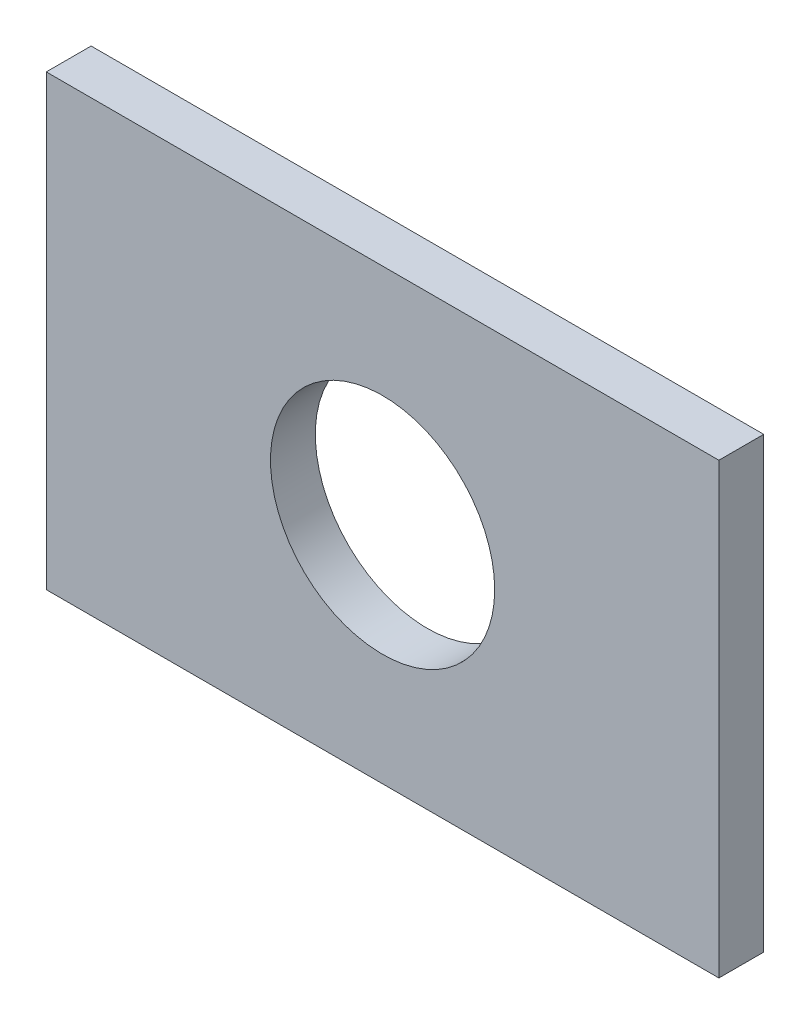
from build123d import *

# Parameters (mm, degrees)
SKETCH1_W           = 150
SKETCH1_H           = 100
BOSS_EXTRUDE1_DEPTH = 10
SKETCH3_R           = 25
CUT_EXTRUDE2_DEPTH  = 10


with BuildPart() as part:
    # Sketch1 → Boss-Extrude1 (new body)
    with BuildSketch(Plane.XY):
        Rectangle(SKETCH1_W, SKETCH1_H)
    extrude(amount=BOSS_EXTRUDE1_DEPTH)

    # Sketch3 → Cut-Extrude2 (cut)
    with BuildSketch(Plane.XY.offset(10)):
        Circle(SKETCH3_R)
    extrude(amount=-CUT_EXTRUDE2_DEPTH, mode=Mode.SUBTRACT)


solid = part.part
